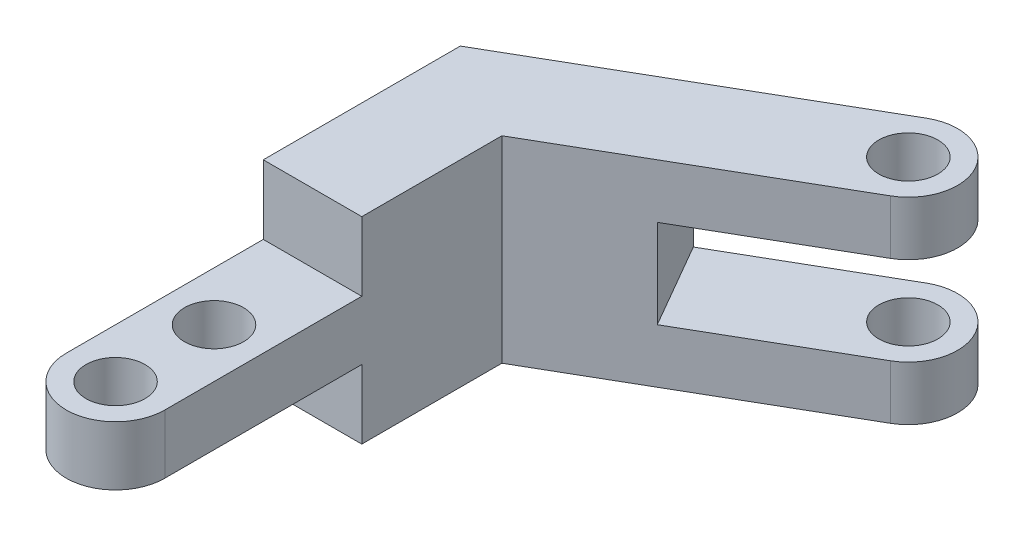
from build123d import *

# Parameters (mm, degrees)
SKETCH1_R           = 1.5
BOSS_EXTRUDE1_DEPTH = 10
CUT_EXTRUDE1_REACH  = 32.949
SKETCH3_W           = 17.320508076
SKETCH3_H           = 4.5
SKETCH5_W           = 5
SKETCH5_H           = 13
CUT_EXTRUDE3_DEPTH  = 3.5
SKETCH6_W           = 5
SKETCH6_H           = 13
CUT_EXTRUDE4_DEPTH  = 3.5


with BuildPart() as part:
    # Sketch1 → Boss-Extrude1 (new body)
    with BuildSketch(Plane(origin=(0, 0, 0), x_dir=(1, 0, 0), z_dir=(0, 1, 0))):
        with BuildLine():
            Line((15, 8.660254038), (0, 0))
            Line((0, 0), (0, -20))
            ThreePointArc((0, -20), (2.5, -22.5), (5, -20))
            Line((5, -20), (5, -2.886751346))
            Line((5, -2.886751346), (17.5, 4.330127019))
            ThreePointArc((17.5, 4.330127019), (18.415063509, 7.745190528), (15, 8.660254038))
        make_face()
        with Locations(Location((2.5, -15, 0), (0, 0, 270))):
            Circle(SKETCH1_R, mode=Mode.SUBTRACT)
        with Locations(Location((2.5, -20, 0), (0, 0, 270))):
            Circle(SKETCH1_R, mode=Mode.SUBTRACT)
        with Locations(Location((16.25, 6.495190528, 0), (0, 0, 270))):
            Circle(SKETCH1_R, mode=Mode.SUBTRACT)
    extrude(amount=BOSS_EXTRUDE1_DEPTH)

    # Cut-Extrude1: up to this face of the body (flat: up to its plane)
    cut_extrude1_end = Plane(part.part.faces().sort_by_distance((11.25, 5, -0.721687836))[0])
    # Sketch3 → Cut-Extrude1 (cut, up to the picked face)
    with BuildSketch(Plane(origin=(0, 0, 0), x_dir=(-0.8660254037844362, 0, 0.5000000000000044), z_dir=(-0.5000000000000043, 0, -0.866025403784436)), mode=Mode.PRIVATE) as cut_extrude1_sk1:
        with Locations((-17.320508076, 5)):
            Rectangle(SKETCH3_W, SKETCH3_H)
    cut_extrude1_tool1 = split(extrude(cut_extrude1_sk1.sketch, amount=-CUT_EXTRUDE1_REACH, mode=Mode.PRIVATE), bisect_by=cut_extrude1_end, keep=Keep.BOTH, mode=Mode.PRIVATE)
    add(cut_extrude1_tool1.solids().sort_by(Axis((15, 5, -8.660254), (0.5000000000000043, 0, 0.866025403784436)))[0], mode=Mode.SUBTRACT)

    # Sketch5 → Cut-Extrude3 (cut)
    with BuildSketch(Plane(origin=(0, 10, 0), x_dir=(1, 0, 0), z_dir=(0, 1, 0))):
        with Locations((2.5, -16.5)):
            Rectangle(SKETCH5_W, SKETCH5_H)
    extrude(amount=-CUT_EXTRUDE3_DEPTH, mode=Mode.SUBTRACT)

    # Sketch6 → Cut-Extrude4 (cut)
    with BuildSketch(Plane.XZ):
        with Locations((2.5, 16.5)):
            Rectangle(SKETCH6_W, SKETCH6_H)
    extrude(amount=-CUT_EXTRUDE4_DEPTH, mode=Mode.SUBTRACT)


solid = part.part
